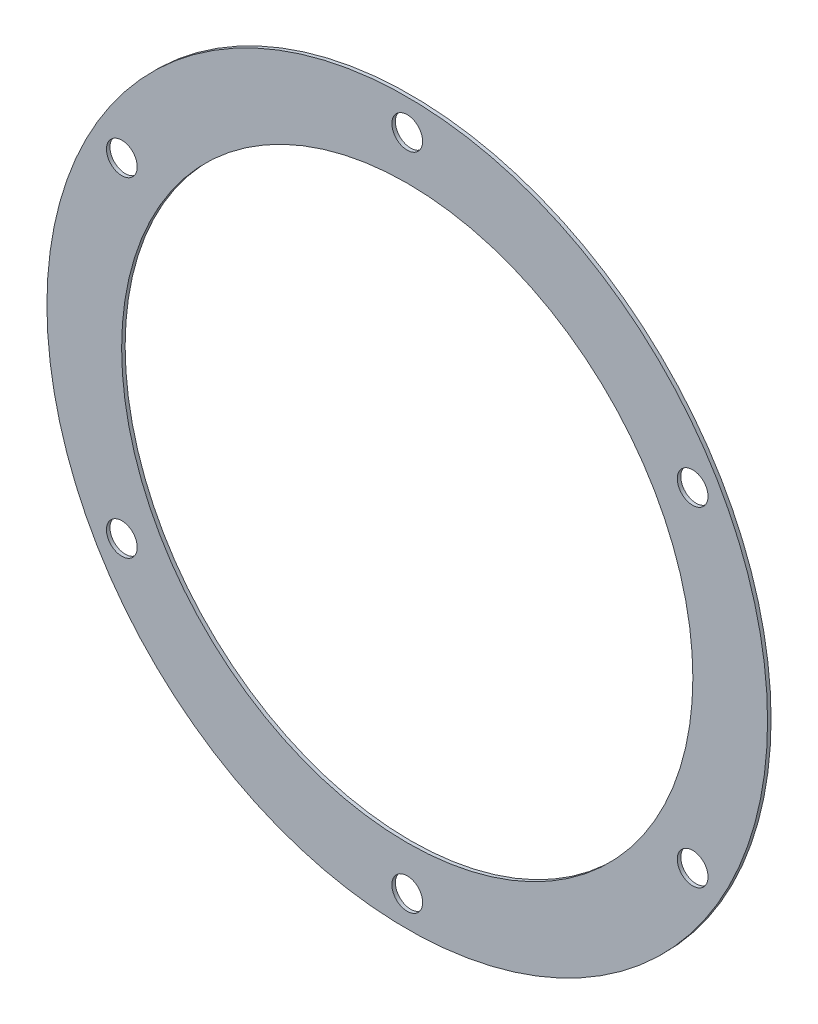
ISO-10303-21;
HEADER;
FILE_DESCRIPTION(('STEP AP214'),'2;1');
FILE_NAME('part.step','',(''),(''),'','','');
FILE_SCHEMA(('AUTOMOTIVE_DESIGN { 1 0 10303 214 1 1 1 1 }'));
ENDSEC;
DATA;
#1=APPLICATION_CONTEXT('core data for automotive mechanical design processes');
#2=APPLICATION_PROTOCOL_DEFINITION('international standard','automotive_design',2000,#1);
#3=PRODUCT_CONTEXT('',#1,'mechanical');
#4=PRODUCT('Part','Part','',(#3));
#5=PRODUCT_RELATED_PRODUCT_CATEGORY('part','',(#4));
#6=PRODUCT_DEFINITION_FORMATION('','',#4);
#7=PRODUCT_DEFINITION_CONTEXT('part definition',#1,'design');
#8=PRODUCT_DEFINITION('design','',#6,#7);
#9=PRODUCT_DEFINITION_SHAPE('','',#8);
#10=(LENGTH_UNIT() NAMED_UNIT(*) SI_UNIT(.MILLI.,.METRE.));
#11=(NAMED_UNIT(*) PLANE_ANGLE_UNIT() SI_UNIT($,.RADIAN.));
#12=(NAMED_UNIT(*) SI_UNIT($,.STERADIAN.) SOLID_ANGLE_UNIT());
#13=UNCERTAINTY_MEASURE_WITH_UNIT(LENGTH_MEASURE(1.E-05),#10,'distance_accuracy_value','');
#14=(GEOMETRIC_REPRESENTATION_CONTEXT(3) GLOBAL_UNCERTAINTY_ASSIGNED_CONTEXT((#13)) GLOBAL_UNIT_ASSIGNED_CONTEXT((#10,
#11,#12)) REPRESENTATION_CONTEXT('',''));
#15=CARTESIAN_POINT('',(0.,0.,0.));
#16=DIRECTION('',(0.,0.,1.));
#17=DIRECTION('',(1.,0.,0.));
#18=AXIS2_PLACEMENT_3D('',#15,#16,#17);
#19=CARTESIAN_POINT('',(0.,0.,2.));
#20=DIRECTION('',(0.,0.,1.));
#21=DIRECTION('',(1.,0.,0.));
#22=AXIS2_PLACEMENT_3D('',#19,#20,#21);
#23=PLANE('',#22);
#24=CARTESIAN_POINT('',(162.379763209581,93.7500000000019,2.));
#25=DIRECTION('',(0.,0.,1.));
#26=DIRECTION('',(1.,0.,0.));
#27=AXIS2_PLACEMENT_3D('',#24,#25,#26);
#28=CIRCLE('',#27,8.74999999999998);
#29=CARTESIAN_POINT('',(171.129763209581,93.7500000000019,2.));
#30=VERTEX_POINT('',#29);
#31=EDGE_CURVE('E81',#30,#30,#28,.T.);
#32=ORIENTED_EDGE('',*,*,#31,.F.);
#33=EDGE_LOOP('',(#32));
#34=FACE_BOUND('',#33,.T.);
#35=CARTESIAN_POINT('',(162.379763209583,-93.7499999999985,2.));
#36=DIRECTION('',(0.,0.,1.));
#37=DIRECTION('',(1.,0.,0.));
#38=AXIS2_PLACEMENT_3D('',#35,#36,#37);
#39=CIRCLE('',#38,8.74999999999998);
#40=CARTESIAN_POINT('',(171.129763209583,-93.7499999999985,2.));
#41=VERTEX_POINT('',#40);
#42=EDGE_CURVE('E75',#41,#41,#39,.T.);
#43=ORIENTED_EDGE('',*,*,#42,.F.);
#44=EDGE_LOOP('',(#43));
#45=FACE_BOUND('',#44,.T.);
#46=CARTESIAN_POINT('',(0.,-187.5,2.));
#47=DIRECTION('',(0.,0.,1.));
#48=DIRECTION('',(1.,0.,0.));
#49=AXIS2_PLACEMENT_3D('',#46,#47,#48);
#50=CIRCLE('',#49,8.74999999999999);
#51=CARTESIAN_POINT('',(8.74999999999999,-187.5,2.));
#52=VERTEX_POINT('',#51);
#53=EDGE_CURVE('E69',#52,#52,#50,.T.);
#54=ORIENTED_EDGE('',*,*,#53,.F.);
#55=EDGE_LOOP('',(#54));
#56=FACE_BOUND('',#55,.T.);
#57=CARTESIAN_POINT('',(-162.379763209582,-93.7500000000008,2.));
#58=DIRECTION('',(0.,0.,1.));
#59=DIRECTION('',(1.,0.,0.));
#60=AXIS2_PLACEMENT_3D('',#57,#58,#59);
#61=CIRCLE('',#60,8.74999999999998);
#62=CARTESIAN_POINT('',(-153.629763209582,-93.7500000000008,2.));
#63=VERTEX_POINT('',#62);
#64=EDGE_CURVE('E63',#63,#63,#61,.T.);
#65=ORIENTED_EDGE('',*,*,#64,.F.);
#66=EDGE_LOOP('',(#65));
#67=FACE_BOUND('',#66,.T.);
#68=CARTESIAN_POINT('',(-162.379763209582,93.7499999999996,2.));
#69=DIRECTION('',(0.,0.,1.));
#70=DIRECTION('',(1.,0.,0.));
#71=AXIS2_PLACEMENT_3D('',#68,#69,#70);
#72=CIRCLE('',#71,8.74999999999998);
#73=CARTESIAN_POINT('',(-153.629763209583,93.7499999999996,2.));
#74=VERTEX_POINT('',#73);
#75=EDGE_CURVE('E57',#74,#74,#72,.T.);
#76=ORIENTED_EDGE('',*,*,#75,.F.);
#77=EDGE_LOOP('',(#76));
#78=FACE_BOUND('',#77,.T.);
#79=CARTESIAN_POINT('',(0.,187.5,2.));
#80=DIRECTION('',(0.,0.,1.));
#81=DIRECTION('',(1.,0.,0.));
#82=AXIS2_PLACEMENT_3D('',#79,#80,#81);
#83=CIRCLE('',#82,8.74999999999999);
#84=CARTESIAN_POINT('',(8.74999999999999,187.5,2.));
#85=VERTEX_POINT('',#84);
#86=EDGE_CURVE('E51',#85,#85,#83,.T.);
#87=ORIENTED_EDGE('',*,*,#86,.F.);
#88=EDGE_LOOP('',(#87));
#89=FACE_BOUND('',#88,.T.);
#90=CARTESIAN_POINT('',(0.,0.,2.));
#91=DIRECTION('',(0.,0.,1.));
#92=DIRECTION('',(1.,0.,0.));
#93=AXIS2_PLACEMENT_3D('',#90,#91,#92);
#94=CIRCLE('',#93,205.);
#95=CARTESIAN_POINT('',(205.,0.,2.));
#96=VERTEX_POINT('',#95);
#97=EDGE_CURVE('E10',#96,#96,#94,.T.);
#98=ORIENTED_EDGE('',*,*,#97,.T.);
#99=EDGE_LOOP('',(#98));
#100=FACE_BOUND('',#99,.T.);
#101=CARTESIAN_POINT('',(0.,0.,2.));
#102=DIRECTION('',(0.,0.,1.));
#103=DIRECTION('',(1.,0.,0.));
#104=AXIS2_PLACEMENT_3D('',#101,#102,#103);
#105=CIRCLE('',#104,162.5);
#106=CARTESIAN_POINT('',(162.5,0.,2.));
#107=VERTEX_POINT('',#106);
#108=EDGE_CURVE('E41',#107,#107,#105,.T.);
#109=ORIENTED_EDGE('',*,*,#108,.F.);
#110=EDGE_LOOP('',(#109));
#111=FACE_BOUND('',#110,.T.);
#112=ADVANCED_FACE('F30',(#34,#45,#56,#67,#78,#89,#100,#111),#23,.T.);
#113=CARTESIAN_POINT('',(0.,0.,0.));
#114=DIRECTION('',(0.,0.,1.));
#115=DIRECTION('',(1.,0.,0.));
#116=AXIS2_PLACEMENT_3D('',#113,#114,#115);
#117=PLANE('',#116);
#118=CARTESIAN_POINT('',(162.379763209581,93.7500000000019,0.));
#119=DIRECTION('',(0.,0.,1.));
#120=DIRECTION('',(1.,0.,0.));
#121=AXIS2_PLACEMENT_3D('',#118,#119,#120);
#122=CIRCLE('',#121,8.74999999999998);
#123=CARTESIAN_POINT('',(171.129763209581,93.7500000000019,0.));
#124=VERTEX_POINT('',#123);
#125=EDGE_CURVE('E78',#124,#124,#122,.T.);
#126=ORIENTED_EDGE('',*,*,#125,.T.);
#127=EDGE_LOOP('',(#126));
#128=FACE_BOUND('',#127,.T.);
#129=CARTESIAN_POINT('',(162.379763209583,-93.7499999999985,0.));
#130=DIRECTION('',(0.,0.,1.));
#131=DIRECTION('',(1.,0.,0.));
#132=AXIS2_PLACEMENT_3D('',#129,#130,#131);
#133=CIRCLE('',#132,8.74999999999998);
#134=CARTESIAN_POINT('',(171.129763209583,-93.7499999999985,0.));
#135=VERTEX_POINT('',#134);
#136=EDGE_CURVE('E72',#135,#135,#133,.T.);
#137=ORIENTED_EDGE('',*,*,#136,.T.);
#138=EDGE_LOOP('',(#137));
#139=FACE_BOUND('',#138,.T.);
#140=CARTESIAN_POINT('',(0.,-187.5,0.));
#141=DIRECTION('',(0.,0.,1.));
#142=DIRECTION('',(1.,0.,0.));
#143=AXIS2_PLACEMENT_3D('',#140,#141,#142);
#144=CIRCLE('',#143,8.74999999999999);
#145=CARTESIAN_POINT('',(8.74999999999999,-187.5,0.));
#146=VERTEX_POINT('',#145);
#147=EDGE_CURVE('E66',#146,#146,#144,.T.);
#148=ORIENTED_EDGE('',*,*,#147,.T.);
#149=EDGE_LOOP('',(#148));
#150=FACE_BOUND('',#149,.T.);
#151=CARTESIAN_POINT('',(-162.379763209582,-93.7500000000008,0.));
#152=DIRECTION('',(0.,0.,1.));
#153=DIRECTION('',(1.,0.,0.));
#154=AXIS2_PLACEMENT_3D('',#151,#152,#153);
#155=CIRCLE('',#154,8.74999999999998);
#156=CARTESIAN_POINT('',(-153.629763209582,-93.7500000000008,0.));
#157=VERTEX_POINT('',#156);
#158=EDGE_CURVE('E60',#157,#157,#155,.T.);
#159=ORIENTED_EDGE('',*,*,#158,.T.);
#160=EDGE_LOOP('',(#159));
#161=FACE_BOUND('',#160,.T.);
#162=CARTESIAN_POINT('',(-162.379763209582,93.7499999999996,0.));
#163=DIRECTION('',(0.,0.,1.));
#164=DIRECTION('',(1.,0.,0.));
#165=AXIS2_PLACEMENT_3D('',#162,#163,#164);
#166=CIRCLE('',#165,8.74999999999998);
#167=CARTESIAN_POINT('',(-153.629763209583,93.7499999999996,0.));
#168=VERTEX_POINT('',#167);
#169=EDGE_CURVE('E54',#168,#168,#166,.T.);
#170=ORIENTED_EDGE('',*,*,#169,.T.);
#171=EDGE_LOOP('',(#170));
#172=FACE_BOUND('',#171,.T.);
#173=CARTESIAN_POINT('',(0.,187.5,0.));
#174=DIRECTION('',(0.,0.,1.));
#175=DIRECTION('',(1.,0.,0.));
#176=AXIS2_PLACEMENT_3D('',#173,#174,#175);
#177=CIRCLE('',#176,8.74999999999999);
#178=CARTESIAN_POINT('',(8.74999999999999,187.5,0.));
#179=VERTEX_POINT('',#178);
#180=EDGE_CURVE('E46',#179,#179,#177,.T.);
#181=ORIENTED_EDGE('',*,*,#180,.T.);
#182=EDGE_LOOP('',(#181));
#183=FACE_BOUND('',#182,.T.);
#184=CARTESIAN_POINT('',(0.,0.,0.));
#185=DIRECTION('',(0.,0.,1.));
#186=DIRECTION('',(1.,0.,0.));
#187=AXIS2_PLACEMENT_3D('',#184,#185,#186);
#188=CIRCLE('',#187,205.);
#189=CARTESIAN_POINT('',(205.,0.,0.));
#190=VERTEX_POINT('',#189);
#191=EDGE_CURVE('E34',#190,#190,#188,.T.);
#192=ORIENTED_EDGE('',*,*,#191,.F.);
#193=EDGE_LOOP('',(#192));
#194=FACE_BOUND('',#193,.T.);
#195=CARTESIAN_POINT('',(0.,0.,0.));
#196=DIRECTION('',(0.,0.,1.));
#197=DIRECTION('',(1.,0.,0.));
#198=AXIS2_PLACEMENT_3D('',#195,#196,#197);
#199=CIRCLE('',#198,162.5);
#200=CARTESIAN_POINT('',(162.5,0.,0.));
#201=VERTEX_POINT('',#200);
#202=EDGE_CURVE('E43',#201,#201,#199,.T.);
#203=ORIENTED_EDGE('',*,*,#202,.T.);
#204=EDGE_LOOP('',(#203));
#205=FACE_BOUND('',#204,.T.);
#206=ADVANCED_FACE('F90',(#128,#139,#150,#161,#172,#183,#194,#205),#117,.F.);
#207=CARTESIAN_POINT('',(0.,0.,2.));
#208=DIRECTION('',(0.,0.,-1.));
#209=DIRECTION('',(-1.,0.,0.));
#210=AXIS2_PLACEMENT_3D('',#207,#208,#209);
#211=CYLINDRICAL_SURFACE('',#210,205.);
#212=ORIENTED_EDGE('',*,*,#97,.F.);
#213=EDGE_LOOP('',(#212));
#214=FACE_BOUND('',#213,.T.);
#215=ORIENTED_EDGE('',*,*,#191,.T.);
#216=EDGE_LOOP('',(#215));
#217=FACE_BOUND('',#216,.T.);
#218=ADVANCED_FACE('F32',(#214,#217),#211,.T.);
#219=CARTESIAN_POINT('',(0.,0.,2.));
#220=DIRECTION('',(0.,0.,-1.));
#221=DIRECTION('',(-1.,0.,0.));
#222=AXIS2_PLACEMENT_3D('',#219,#220,#221);
#223=CYLINDRICAL_SURFACE('',#222,162.5);
#224=ORIENTED_EDGE('',*,*,#108,.T.);
#225=EDGE_LOOP('',(#224));
#226=FACE_BOUND('',#225,.T.);
#227=ORIENTED_EDGE('',*,*,#202,.F.);
#228=EDGE_LOOP('',(#227));
#229=FACE_BOUND('',#228,.T.);
#230=ADVANCED_FACE('F104',(#226,#229),#223,.F.);
#231=CARTESIAN_POINT('',(0.,187.5,2.));
#232=DIRECTION('',(0.,0.,1.));
#233=DIRECTION('',(1.,0.,0.));
#234=AXIS2_PLACEMENT_3D('',#231,#232,#233);
#235=CYLINDRICAL_SURFACE('',#234,8.74999999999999);
#236=ORIENTED_EDGE('',*,*,#86,.T.);
#237=EDGE_LOOP('',(#236));
#238=FACE_BOUND('',#237,.T.);
#239=ORIENTED_EDGE('',*,*,#180,.F.);
#240=EDGE_LOOP('',(#239));
#241=FACE_BOUND('',#240,.T.);
#242=ADVANCED_FACE('F107',(#238,#241),#235,.F.);
#243=CARTESIAN_POINT('',(-162.379763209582,93.7499999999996,2.));
#244=DIRECTION('',(0.,0.,1.));
#245=DIRECTION('',(1.,0.,0.));
#246=AXIS2_PLACEMENT_3D('',#243,#244,#245);
#247=CYLINDRICAL_SURFACE('',#246,8.74999999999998);
#248=ORIENTED_EDGE('',*,*,#75,.T.);
#249=EDGE_LOOP('',(#248));
#250=FACE_BOUND('',#249,.T.);
#251=ORIENTED_EDGE('',*,*,#169,.F.);
#252=EDGE_LOOP('',(#251));
#253=FACE_BOUND('',#252,.T.);
#254=ADVANCED_FACE('F121',(#250,#253),#247,.F.);
#255=CARTESIAN_POINT('',(-162.379763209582,-93.7500000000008,2.));
#256=DIRECTION('',(0.,0.,1.));
#257=DIRECTION('',(1.,0.,0.));
#258=AXIS2_PLACEMENT_3D('',#255,#256,#257);
#259=CYLINDRICAL_SURFACE('',#258,8.74999999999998);
#260=ORIENTED_EDGE('',*,*,#64,.T.);
#261=EDGE_LOOP('',(#260));
#262=FACE_BOUND('',#261,.T.);
#263=ORIENTED_EDGE('',*,*,#158,.F.);
#264=EDGE_LOOP('',(#263));
#265=FACE_BOUND('',#264,.T.);
#266=ADVANCED_FACE('F125',(#262,#265),#259,.F.);
#267=CARTESIAN_POINT('',(0.,-187.5,2.));
#268=DIRECTION('',(0.,0.,1.));
#269=DIRECTION('',(1.,0.,0.));
#270=AXIS2_PLACEMENT_3D('',#267,#268,#269);
#271=CYLINDRICAL_SURFACE('',#270,8.74999999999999);
#272=ORIENTED_EDGE('',*,*,#53,.T.);
#273=EDGE_LOOP('',(#272));
#274=FACE_BOUND('',#273,.T.);
#275=ORIENTED_EDGE('',*,*,#147,.F.);
#276=EDGE_LOOP('',(#275));
#277=FACE_BOUND('',#276,.T.);
#278=ADVANCED_FACE('F129',(#274,#277),#271,.F.);
#279=CARTESIAN_POINT('',(162.379763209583,-93.7499999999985,2.));
#280=DIRECTION('',(0.,0.,1.));
#281=DIRECTION('',(1.,0.,0.));
#282=AXIS2_PLACEMENT_3D('',#279,#280,#281);
#283=CYLINDRICAL_SURFACE('',#282,8.74999999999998);
#284=ORIENTED_EDGE('',*,*,#42,.T.);
#285=EDGE_LOOP('',(#284));
#286=FACE_BOUND('',#285,.T.);
#287=ORIENTED_EDGE('',*,*,#136,.F.);
#288=EDGE_LOOP('',(#287));
#289=FACE_BOUND('',#288,.T.);
#290=ADVANCED_FACE('F133',(#286,#289),#283,.F.);
#291=CARTESIAN_POINT('',(162.379763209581,93.7500000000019,2.));
#292=DIRECTION('',(0.,0.,1.));
#293=DIRECTION('',(1.,0.,0.));
#294=AXIS2_PLACEMENT_3D('',#291,#292,#293);
#295=CYLINDRICAL_SURFACE('',#294,8.74999999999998);
#296=ORIENTED_EDGE('',*,*,#31,.T.);
#297=EDGE_LOOP('',(#296));
#298=FACE_BOUND('',#297,.T.);
#299=ORIENTED_EDGE('',*,*,#125,.F.);
#300=EDGE_LOOP('',(#299));
#301=FACE_BOUND('',#300,.T.);
#302=ADVANCED_FACE('F85',(#298,#301),#295,.F.);
#303=CLOSED_SHELL('',(#112,#206,#218,#230,#242,#254,#266,#278,#290,#302));
#304=MANIFOLD_SOLID_BREP('B2',#303);
#305=ADVANCED_BREP_SHAPE_REPRESENTATION('',(#18,#304),#14);
#306=SHAPE_DEFINITION_REPRESENTATION(#9,#305);
ENDSEC;
END-ISO-10303-21;
